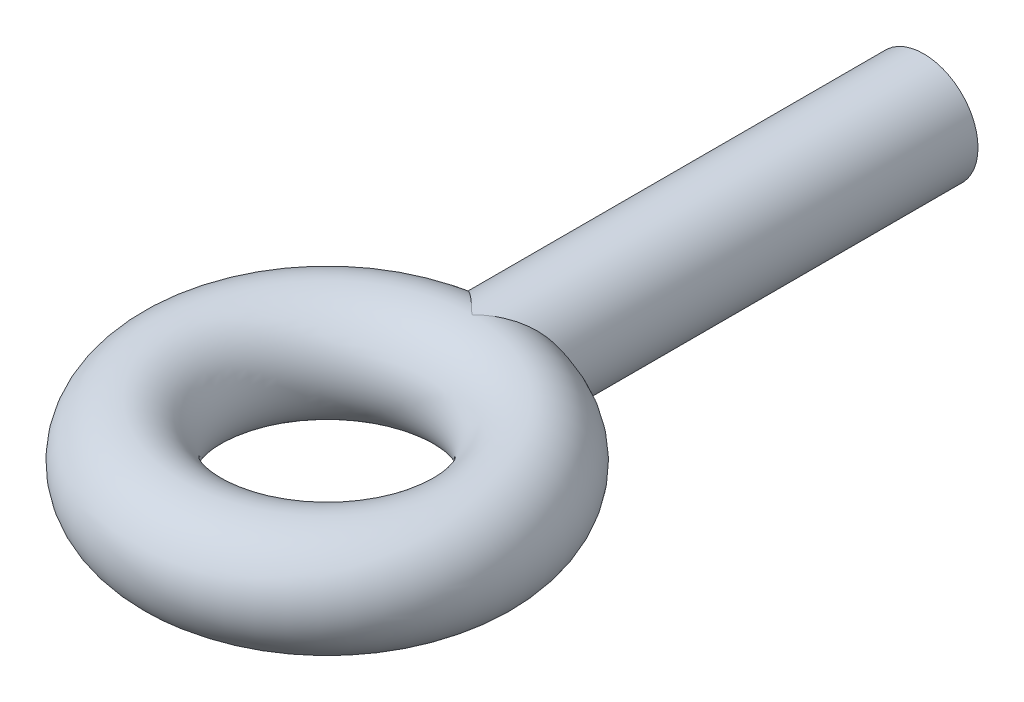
from build123d import *

# Parameters (mm, degrees)
SKETCH1_R           = 6
BOSS_EXTRUDE1_DEPTH = 50
SKETCH2_R           = 6


with BuildPart() as part:
    # Sketch1 → Boss-Extrude1 (new body)
    with BuildSketch(Plane.XY):
        Circle(SKETCH1_R)
    extrude(amount=BOSS_EXTRUDE1_DEPTH)

    # Sketch2 → Revolve1 (revolve)
    with BuildSketch(Plane(origin=(0, 0, 0), x_dir=(0, 0, -1), z_dir=(1, 0, 0)), mode=Mode.PRIVATE) as revolve1_sk:
        with Locations((-50, 0)):
            Circle(SKETCH2_R)
    revolve(revolve1_sk.sketch.rotate(Axis((0, 0, 66), (0, 1, 0)), 180), axis=Axis((0, 0, 66), (0, 1, 0)))


solid = part.part
